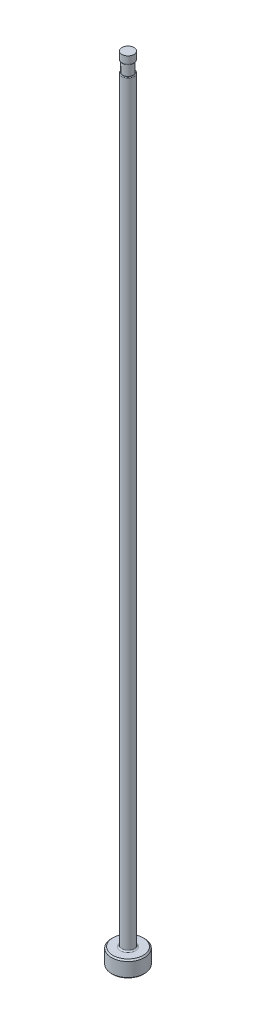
ISO-10303-21;
HEADER;
FILE_DESCRIPTION(('STEP AP214'),'2;1');
FILE_NAME('part.step','',(''),(''),'','','');
FILE_SCHEMA(('AUTOMOTIVE_DESIGN { 1 0 10303 214 1 1 1 1 }'));
ENDSEC;
DATA;
#1=APPLICATION_CONTEXT('core data for automotive mechanical design processes');
#2=APPLICATION_PROTOCOL_DEFINITION('international standard','automotive_design',2000,#1);
#3=PRODUCT_CONTEXT('',#1,'mechanical');
#4=PRODUCT('Part','Part','',(#3));
#5=PRODUCT_RELATED_PRODUCT_CATEGORY('part','',(#4));
#6=PRODUCT_DEFINITION_FORMATION('','',#4);
#7=PRODUCT_DEFINITION_CONTEXT('part definition',#1,'design');
#8=PRODUCT_DEFINITION('design','',#6,#7);
#9=PRODUCT_DEFINITION_SHAPE('','',#8);
#10=(LENGTH_UNIT() NAMED_UNIT(*) SI_UNIT(.MILLI.,.METRE.));
#11=(NAMED_UNIT(*) PLANE_ANGLE_UNIT() SI_UNIT($,.RADIAN.));
#12=(NAMED_UNIT(*) SI_UNIT($,.STERADIAN.) SOLID_ANGLE_UNIT());
#13=UNCERTAINTY_MEASURE_WITH_UNIT(LENGTH_MEASURE(1.E-05),#10,'distance_accuracy_value','');
#14=(GEOMETRIC_REPRESENTATION_CONTEXT(3) GLOBAL_UNCERTAINTY_ASSIGNED_CONTEXT((#13)) GLOBAL_UNIT_ASSIGNED_CONTEXT((#10,
#11,#12)) REPRESENTATION_CONTEXT('',''));
#15=CARTESIAN_POINT('',(0.,0.,0.));
#16=DIRECTION('',(0.,0.,1.));
#17=DIRECTION('',(1.,0.,0.));
#18=AXIS2_PLACEMENT_3D('',#15,#16,#17);
#19=CARTESIAN_POINT('',(-1.18998999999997,150.876,0.));
#20=DIRECTION('',(0.,1.,0.));
#21=DIRECTION('',(0.,0.,1.));
#22=AXIS2_PLACEMENT_3D('',#19,#20,#21);
#23=PLANE('',#22);
#24=CARTESIAN_POINT('',(0.,150.876,0.));
#25=DIRECTION('',(0.,1.,0.));
#26=DIRECTION('',(0.,0.,1.));
#27=AXIS2_PLACEMENT_3D('',#24,#25,#26);
#28=CIRCLE('',#27,1.03758999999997);
#29=CARTESIAN_POINT('',(0.,150.876,1.03758999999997));
#30=VERTEX_POINT('',#29);
#31=EDGE_CURVE('E11',#30,#30,#28,.F.);
#32=ORIENTED_EDGE('',*,*,#31,.T.);
#33=EDGE_LOOP('',(#32));
#34=FACE_BOUND('',#33,.T.);
#35=CARTESIAN_POINT('',(0.,150.876,0.));
#36=DIRECTION('',(0.,1.,0.));
#37=DIRECTION('',(0.,0.,1.));
#38=AXIS2_PLACEMENT_3D('',#35,#36,#37);
#39=CIRCLE('',#38,0.986789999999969);
#40=CARTESIAN_POINT('',(0.,150.876,0.986789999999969));
#41=VERTEX_POINT('',#40);
#42=EDGE_CURVE('E78',#41,#41,#39,.T.);
#43=ORIENTED_EDGE('',*,*,#42,.T.);
#44=EDGE_LOOP('',(#43));
#45=FACE_BOUND('',#44,.T.);
#46=ADVANCED_FACE('F36',(#34,#45),#23,.F.);
#47=CARTESIAN_POINT('',(0.,259.958771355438,0.));
#48=DIRECTION('',(0.,1.,0.));
#49=DIRECTION('',(0.,0.,1.));
#50=AXIS2_PLACEMENT_3D('',#47,#48,#49);
#51=CYLINDRICAL_SURFACE('',#50,1.18998999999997);
#52=DIRECTION('',(0.,1.,0.));
#53=VECTOR('',#52,1.);
#54=CARTESIAN_POINT('',(-0.986789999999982,259.958771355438,-0.66507269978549));
#55=LINE('',#54,#53);
#56=CARTESIAN_POINT('',(-0.986789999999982,148.717,-0.66507269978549));
#57=VERTEX_POINT('',#56);
#58=CARTESIAN_POINT('',(-0.986789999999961,86.36,-0.665072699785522));
#59=VERTEX_POINT('',#58);
#60=EDGE_CURVE('E73',#57,#59,#55,.F.);
#61=ORIENTED_EDGE('',*,*,#60,.F.);
#62=CARTESIAN_POINT('',(0.,148.717,0.));
#63=DIRECTION('',(0.,-1.,0.));
#64=DIRECTION('',(0.,0.,-1.));
#65=AXIS2_PLACEMENT_3D('',#62,#63,#64);
#66=CIRCLE('',#65,1.18998999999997);
#67=CARTESIAN_POINT('',(-0.986789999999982,148.717,0.66507269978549));
#68=VERTEX_POINT('',#67);
#69=EDGE_CURVE('E51',#57,#68,#66,.T.);
#70=ORIENTED_EDGE('',*,*,#69,.T.);
#71=DIRECTION('',(0.,1.,0.));
#72=VECTOR('',#71,1.);
#73=CARTESIAN_POINT('',(-0.986789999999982,259.958771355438,0.66507269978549));
#74=LINE('',#73,#72);
#75=CARTESIAN_POINT('',(-0.986789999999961,86.36,0.665072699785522));
#76=VERTEX_POINT('',#75);
#77=EDGE_CURVE('E84',#76,#68,#74,.T.);
#78=ORIENTED_EDGE('',*,*,#77,.F.);
#79=CARTESIAN_POINT('',(-0.98678999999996,86.36,-0.665072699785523));
#80=CARTESIAN_POINT('',(-0.986779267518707,86.3097455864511,-0.665041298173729));
#81=CARTESIAN_POINT('',(-0.987982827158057,86.2594764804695,-0.663300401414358));
#82=CARTESIAN_POINT('',(-0.992752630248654,86.1591549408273,-0.656166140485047));
#83=CARTESIAN_POINT('',(-0.996326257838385,86.1091036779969,-0.650761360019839));
#84=CARTESIAN_POINT('',(-1.00583006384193,86.0091462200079,-0.635968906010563));
#85=CARTESIAN_POINT('',(-1.01178989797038,85.9592501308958,-0.626531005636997));
#86=CARTESIAN_POINT('',(-1.02587369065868,85.8608860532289,-0.603197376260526));
#87=CARTESIAN_POINT('',(-1.03399424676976,85.8124159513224,-0.589308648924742));
#88=CARTESIAN_POINT('',(-1.05174573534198,85.7193689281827,-0.556987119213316));
#89=CARTESIAN_POINT('',(-1.06130874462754,85.6747141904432,-0.538743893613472));
#90=CARTESIAN_POINT('',(-1.08163376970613,85.5885015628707,-0.496679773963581));
#91=CARTESIAN_POINT('',(-1.09239187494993,85.5469342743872,-0.472876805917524));
#92=CARTESIAN_POINT('',(-1.11191043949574,85.4768889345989,-0.424562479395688));
#93=CARTESIAN_POINT('',(-1.12059949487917,85.4475247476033,-0.401318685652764));
#94=CARTESIAN_POINT('',(-1.13756139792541,85.3927968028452,-0.350355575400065));
#95=CARTESIAN_POINT('',(-1.1458348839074,85.3674267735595,-0.322643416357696));
#96=CARTESIAN_POINT('',(-1.15898696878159,85.3284463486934,-0.270798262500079));
#97=CARTESIAN_POINT('',(-1.16417674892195,85.3135145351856,-0.24774326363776));
#98=CARTESIAN_POINT('',(-1.17342649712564,85.2873860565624,-0.19937625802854));
#99=CARTESIAN_POINT('',(-1.17748715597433,85.2761871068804,-0.174065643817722));
#100=CARTESIAN_POINT('',(-1.18407630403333,85.2582102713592,-0.121438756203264));
#101=CARTESIAN_POINT('',(-1.18659047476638,85.2514736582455,-0.0941062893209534));
#102=CARTESIAN_POINT('',(-1.18968900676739,85.2431911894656,-0.0385610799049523));
#103=CARTESIAN_POINT('',(-1.19027509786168,85.2416406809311,-0.0103491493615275));
#104=CARTESIAN_POINT('',(-1.18949770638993,85.2437102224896,0.0419738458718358));
#105=CARTESIAN_POINT('',(-1.18838954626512,85.2466530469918,0.0661187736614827));
#106=CARTESIAN_POINT('',(-1.18479997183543,85.2562873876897,0.113537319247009));
#107=CARTESIAN_POINT('',(-1.1823183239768,85.26297954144,0.136810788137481));
#108=CARTESIAN_POINT('',(-1.17619659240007,85.279751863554,0.182112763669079));
#109=CARTESIAN_POINT('',(-1.17254841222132,85.2898557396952,0.20413126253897));
#110=CARTESIAN_POINT('',(-1.16439345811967,85.3129140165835,0.246432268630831));
#111=CARTESIAN_POINT('',(-1.15988634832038,85.3258695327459,0.266714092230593));
#112=CARTESIAN_POINT('',(-1.14755888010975,85.3622124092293,0.31649477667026));
#113=CARTESIAN_POINT('',(-1.13931800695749,85.3873279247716,0.344629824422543));
#114=CARTESIAN_POINT('',(-1.12235845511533,85.4416867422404,0.396399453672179));
#115=CARTESIAN_POINT('',(-1.11363866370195,85.4709399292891,0.420022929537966));
#116=CARTESIAN_POINT('',(-1.09186647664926,85.5484930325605,0.474520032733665));
#117=CARTESIAN_POINT('',(-1.07894485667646,85.5987247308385,0.502681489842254));
#118=CARTESIAN_POINT('',(-1.05496207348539,85.703372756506,0.551237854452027));
#119=CARTESIAN_POINT('',(-1.04391025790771,85.7578082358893,0.571594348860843));
#120=CARTESIAN_POINT('',(-1.02648158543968,85.8575321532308,0.60220362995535));
#121=CARTESIAN_POINT('',(-1.01961050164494,85.902371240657,0.613676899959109));
#122=CARTESIAN_POINT('',(-1.00772789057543,85.9931036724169,0.633000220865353));
#123=CARTESIAN_POINT('',(-1.00271814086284,86.0389979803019,0.640846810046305));
#124=CARTESIAN_POINT('',(-0.99475556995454,86.130656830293,0.653140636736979));
#125=CARTESIAN_POINT('',(-0.991771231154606,86.1764117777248,0.657640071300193));
#126=CARTESIAN_POINT('',(-0.987786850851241,86.2681143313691,0.663592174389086));
#127=CARTESIAN_POINT('',(-0.986782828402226,86.314061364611,0.66505095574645));
#128=CARTESIAN_POINT('',(-0.986789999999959,86.36,0.665072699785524));
#129=B_SPLINE_CURVE_WITH_KNOTS('',3,(#79,#80,#81,#82,#83,#84,#85,#86,#87,#88,#89,#90,#91,#92,
#93,#94,#95,#96,#97,#98,#99,#100,#101,#102,#103,#104,#105,#106,#107,#108,#109,#110,#111,#112,
#113,#114,#115,#116,#117,#118,#119,#120,#121,#122,#123,#124,#125,#126,#127,#128),.UNSPECIFIED.,
.F.,.F.,(4,2,2,2,2,2,2,2,2,2,2,2,2,2,2,2,2,2,2,2,2,2,2,2,4),(0.,0.150742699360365,
0.301957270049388,0.455112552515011,0.608028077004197,0.75521904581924,0.901941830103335,
1.01691912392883,1.13171404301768,1.21527204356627,1.29877881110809,1.38304754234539,
1.46724064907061,1.53993547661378,1.61264266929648,1.68586586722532,1.75911775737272,
1.8742700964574,1.98970233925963,2.16578434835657,2.34272217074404,2.48289840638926,
2.62320816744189,2.7612811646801,2.8990763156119),.UNSPECIFIED.);
#130=EDGE_CURVE('E81',#59,#76,#129,.T.);
#131=ORIENTED_EDGE('',*,*,#130,.F.);
#132=EDGE_LOOP('',(#61,#70,#78,#131));
#133=FACE_BOUND('',#132,.T.);
#134=CARTESIAN_POINT('',(0.,3.42900000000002,0.));
#135=DIRECTION('',(0.,1.,0.));
#136=DIRECTION('',(0.,0.,1.));
#137=AXIS2_PLACEMENT_3D('',#134,#135,#136);
#138=CIRCLE('',#137,1.18998999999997);
#139=CARTESIAN_POINT('',(0.,3.42900000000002,1.18998999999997));
#140=VERTEX_POINT('',#139);
#141=EDGE_CURVE('E116',#140,#140,#138,.T.);
#142=ORIENTED_EDGE('',*,*,#141,.T.);
#143=EDGE_LOOP('',(#142));
#144=FACE_BOUND('',#143,.T.);
#145=ADVANCED_FACE('F82',(#133,#144),#51,.T.);
#146=CARTESIAN_POINT('',(0.,0.,0.));
#147=DIRECTION('',(0.,-1.,0.));
#148=DIRECTION('',(0.,0.,-1.));
#149=AXIS2_PLACEMENT_3D('',#146,#147,#148);
#150=PLANE('',#149);
#151=CARTESIAN_POINT('',(0.,0.,0.));
#152=DIRECTION('',(0.,-1.,0.));
#153=DIRECTION('',(0.,0.,-1.));
#154=AXIS2_PLACEMENT_3D('',#151,#152,#153);
#155=CIRCLE('',#154,2.92099999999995);
#156=CARTESIAN_POINT('',(0.,0.,-2.92099999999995));
#157=VERTEX_POINT('',#156);
#158=EDGE_CURVE('E113',#157,#157,#155,.T.);
#159=ORIENTED_EDGE('',*,*,#158,.T.);
#160=EDGE_LOOP('',(#159));
#161=FACE_BOUND('',#160,.T.);
#162=ADVANCED_FACE('F192',(#161),#150,.T.);
#163=CARTESIAN_POINT('',(0.,259.958771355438,0.));
#164=DIRECTION('',(0.,1.,0.));
#165=DIRECTION('',(0.,0.,1.));
#166=AXIS2_PLACEMENT_3D('',#163,#164,#165);
#167=CYLINDRICAL_SURFACE('',#166,3.17499999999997);
#168=CARTESIAN_POINT('',(0.,2.92100000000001,0.));
#169=DIRECTION('',(0.,1.,0.));
#170=DIRECTION('',(0.,0.,1.));
#171=AXIS2_PLACEMENT_3D('',#168,#169,#170);
#172=CIRCLE('',#171,3.17499999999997);
#173=CARTESIAN_POINT('',(0.,2.92100000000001,3.17499999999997));
#174=VERTEX_POINT('',#173);
#175=EDGE_CURVE('E110',#174,#174,#172,.F.);
#176=ORIENTED_EDGE('',*,*,#175,.T.);
#177=EDGE_LOOP('',(#176));
#178=FACE_BOUND('',#177,.T.);
#179=CARTESIAN_POINT('',(0.,0.254000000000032,0.));
#180=DIRECTION('',(0.,-1.,0.));
#181=DIRECTION('',(0.,0.,-1.));
#182=AXIS2_PLACEMENT_3D('',#179,#180,#181);
#183=CIRCLE('',#182,3.17499999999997);
#184=CARTESIAN_POINT('',(0.,0.254000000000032,-3.17499999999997));
#185=VERTEX_POINT('',#184);
#186=EDGE_CURVE('E107',#185,#185,#183,.F.);
#187=ORIENTED_EDGE('',*,*,#186,.T.);
#188=EDGE_LOOP('',(#187));
#189=FACE_BOUND('',#188,.T.);
#190=ADVANCED_FACE('F195',(#178,#189),#167,.T.);
#191=CARTESIAN_POINT('',(-3.17499999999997,3.175,0.));
#192=DIRECTION('',(0.,1.,0.));
#193=DIRECTION('',(0.,0.,1.));
#194=AXIS2_PLACEMENT_3D('',#191,#192,#193);
#195=PLANE('',#194);
#196=CARTESIAN_POINT('',(0.,3.175,0.));
#197=DIRECTION('',(0.,1.,0.));
#198=DIRECTION('',(0.,0.,1.));
#199=AXIS2_PLACEMENT_3D('',#196,#197,#198);
#200=CIRCLE('',#199,1.44398999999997);
#201=CARTESIAN_POINT('',(0.,3.175,1.44398999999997));
#202=VERTEX_POINT('',#201);
#203=EDGE_CURVE('E87',#202,#202,#200,.F.);
#204=ORIENTED_EDGE('',*,*,#203,.T.);
#205=EDGE_LOOP('',(#204));
#206=FACE_BOUND('',#205,.T.);
#207=CARTESIAN_POINT('',(0.,3.175,0.));
#208=DIRECTION('',(0.,1.,0.));
#209=DIRECTION('',(0.,0.,1.));
#210=AXIS2_PLACEMENT_3D('',#207,#208,#209);
#211=CIRCLE('',#210,2.92099999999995);
#212=CARTESIAN_POINT('',(0.,3.175,2.92099999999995));
#213=VERTEX_POINT('',#212);
#214=EDGE_CURVE('E104',#213,#213,#211,.T.);
#215=ORIENTED_EDGE('',*,*,#214,.T.);
#216=EDGE_LOOP('',(#215));
#217=FACE_BOUND('',#216,.T.);
#218=ADVANCED_FACE('F190',(#206,#217),#195,.T.);
#219=CARTESIAN_POINT('',(0.,3.17499999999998,0.));
#220=DIRECTION('',(0.,-1.,0.));
#221=DIRECTION('',(0.,0.,-1.));
#222=AXIS2_PLACEMENT_3D('',#219,#220,#221);
#223=CONICAL_SURFACE('',#222,2.92099999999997,0.7853981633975);
#224=ORIENTED_EDGE('',*,*,#175,.F.);
#225=EDGE_LOOP('',(#224));
#226=FACE_BOUND('',#225,.T.);
#227=ORIENTED_EDGE('',*,*,#214,.F.);
#228=EDGE_LOOP('',(#227));
#229=FACE_BOUND('',#228,.T.);
#230=ADVANCED_FACE('F186',(#226,#229),#223,.T.);
#231=CARTESIAN_POINT('',(0.,0.254000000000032,0.));
#232=DIRECTION('',(0.,1.,0.));
#233=DIRECTION('',(0.,0.,1.));
#234=AXIS2_PLACEMENT_3D('',#231,#232,#233);
#235=CONICAL_SURFACE('',#234,3.17499999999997,0.785398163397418);
#236=ORIENTED_EDGE('',*,*,#158,.F.);
#237=EDGE_LOOP('',(#236));
#238=FACE_BOUND('',#237,.T.);
#239=ORIENTED_EDGE('',*,*,#186,.F.);
#240=EDGE_LOOP('',(#239));
#241=FACE_BOUND('',#240,.T.);
#242=ADVANCED_FACE('F182',(#238,#241),#235,.T.);
#243=CARTESIAN_POINT('',(0.,3.42900000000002,0.));
#244=DIRECTION('',(0.,1.,0.));
#245=DIRECTION('',(0.,0.,1.));
#246=AXIS2_PLACEMENT_3D('',#243,#244,#245);
#247=TOROIDAL_SURFACE('',#246,1.44398999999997,0.254);
#248=ORIENTED_EDGE('',*,*,#203,.F.);
#249=EDGE_LOOP('',(#248));
#250=FACE_BOUND('',#249,.T.);
#251=ORIENTED_EDGE('',*,*,#141,.F.);
#252=EDGE_LOOP('',(#251));
#253=FACE_BOUND('',#252,.T.);
#254=ADVANCED_FACE('F147',(#250,#253),#247,.F.);
#255=CARTESIAN_POINT('',(-1.18998999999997,148.844,0.));
#256=DIRECTION('',(0.,-1.,0.));
#257=DIRECTION('',(0.,0.,-1.));
#258=AXIS2_PLACEMENT_3D('',#255,#256,#257);
#259=PLANE('',#258);
#260=DIRECTION('',(0.,0.,1.));
#261=VECTOR('',#260,1.);
#262=CARTESIAN_POINT('',(-0.986789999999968,148.844,0.));
#263=LINE('',#262,#261);
#264=CARTESIAN_POINT('',(-0.986789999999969,148.844,0.));
#265=VERTEX_POINT('',#264);
#266=CARTESIAN_POINT('',(-0.986789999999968,148.844,0.39521289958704));
#267=VERTEX_POINT('',#266);
#268=EDGE_CURVE('E90',#265,#267,#263,.T.);
#269=ORIENTED_EDGE('',*,*,#268,.T.);
#270=CARTESIAN_POINT('',(0.,148.844,0.));
#271=DIRECTION('',(0.,-1.,0.));
#272=DIRECTION('',(0.,0.,-1.));
#273=AXIS2_PLACEMENT_3D('',#270,#271,#272);
#274=CIRCLE('',#273,1.06298999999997);
#275=CARTESIAN_POINT('',(-0.986789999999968,148.844,-0.39521289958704));
#276=VERTEX_POINT('',#275);
#277=EDGE_CURVE('E86',#267,#276,#274,.F.);
#278=ORIENTED_EDGE('',*,*,#277,.T.);
#279=EDGE_CURVE('E79',#276,#265,#263,.T.);
#280=ORIENTED_EDGE('',*,*,#279,.T.);
#281=CARTESIAN_POINT('',(0.,148.844,0.));
#282=DIRECTION('',(0.,1.,0.));
#283=DIRECTION('',(0.,0.,1.));
#284=AXIS2_PLACEMENT_3D('',#281,#282,#283);
#285=CIRCLE('',#284,0.986789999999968);
#286=EDGE_CURVE('E101',#265,#265,#285,.T.);
#287=ORIENTED_EDGE('',*,*,#286,.F.);
#288=EDGE_LOOP('',(#269,#278,#280,#287));
#289=FACE_BOUND('',#288,.T.);
#290=ADVANCED_FACE('F144',(#289),#259,.F.);
#291=CARTESIAN_POINT('',(0.,153.448281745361,0.));
#292=DIRECTION('',(0.,1.,0.));
#293=DIRECTION('',(0.,0.,1.));
#294=AXIS2_PLACEMENT_3D('',#291,#292,#293);
#295=CYLINDRICAL_SURFACE('',#294,0.986789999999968);
#296=ORIENTED_EDGE('',*,*,#42,.F.);
#297=EDGE_LOOP('',(#296));
#298=FACE_BOUND('',#297,.T.);
#299=ORIENTED_EDGE('',*,*,#286,.T.);
#300=EDGE_LOOP('',(#299));
#301=FACE_BOUND('',#300,.T.);
#302=ADVANCED_FACE('F141',(#298,#301),#295,.T.);
#303=CARTESIAN_POINT('',(-0.986789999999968,149.86,-3.17499999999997));
#304=DIRECTION('',(1.,0.,0.));
#305=DIRECTION('',(0.,1.,0.));
#306=AXIS2_PLACEMENT_3D('',#303,#304,#305);
#307=PLANE('',#306);
#308=ORIENTED_EDGE('',*,*,#279,.F.);
#309=CARTESIAN_POINT('',(-0.986789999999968,148.844,-0.39521289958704));
#310=CARTESIAN_POINT('',(-0.986789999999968,148.843995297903,-0.407444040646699));
#311=CARTESIAN_POINT('',(-0.986789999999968,148.843755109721,-0.419683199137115));
#312=CARTESIAN_POINT('',(-0.986789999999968,148.842653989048,-0.444183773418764));
#313=CARTESIAN_POINT('',(-0.986789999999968,148.841790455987,-0.456445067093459));
#314=CARTESIAN_POINT('',(-0.986789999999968,148.839278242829,-0.481011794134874));
#315=CARTESIAN_POINT('',(-0.986789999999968,148.837621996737,-0.493316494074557));
#316=CARTESIAN_POINT('',(-0.986789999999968,148.833322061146,-0.517737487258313));
#317=CARTESIAN_POINT('',(-0.986789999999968,148.830680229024,-0.529854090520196));
#318=CARTESIAN_POINT('',(-0.986789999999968,148.825166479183,-0.550007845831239));
#319=CARTESIAN_POINT('',(-0.986789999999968,148.822625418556,-0.558134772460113));
#320=CARTESIAN_POINT('',(-0.986789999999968,148.816838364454,-0.574135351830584));
#321=CARTESIAN_POINT('',(-0.986789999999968,148.81359268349,-0.582009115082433));
#322=CARTESIAN_POINT('',(-0.986789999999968,148.806227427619,-0.597422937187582));
#323=CARTESIAN_POINT('',(-0.986789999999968,148.80210093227,-0.60495974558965));
#324=CARTESIAN_POINT('',(-0.986789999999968,148.79281754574,-0.619377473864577));
#325=CARTESIAN_POINT('',(-0.986789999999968,148.787662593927,-0.626259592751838));
#326=CARTESIAN_POINT('',(-0.986789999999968,148.778322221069,-0.636549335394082));
#327=CARTESIAN_POINT('',(-0.986789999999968,148.774503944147,-0.64028870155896));
#328=CARTESIAN_POINT('',(-0.986789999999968,148.766372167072,-0.647191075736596));
#329=CARTESIAN_POINT('',(-0.986789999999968,148.76205907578,-0.650354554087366));
#330=CARTESIAN_POINT('',(-0.986789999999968,148.753638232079,-0.655489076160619));
#331=CARTESIAN_POINT('',(-0.986789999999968,148.749596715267,-0.657567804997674));
#332=CARTESIAN_POINT('',(-0.986789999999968,148.741227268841,-0.661024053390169));
#333=CARTESIAN_POINT('',(-0.986789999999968,148.73690005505,-0.66240325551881));
#334=CARTESIAN_POINT('',(-0.986789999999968,148.72994708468,-0.663934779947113));
#335=CARTESIAN_POINT('',(-0.986789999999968,148.727379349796,-0.664359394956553));
#336=CARTESIAN_POINT('',(-0.986789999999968,148.722208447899,-0.664929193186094));
#337=CARTESIAN_POINT('',(-0.986789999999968,148.719605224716,-0.665073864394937));
#338=CARTESIAN_POINT('',(-0.986789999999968,148.717000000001,-0.665072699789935));
#339=B_SPLINE_CURVE_WITH_KNOTS('',3,(#309,#310,#311,#312,#313,#314,#315,#316,#317,#318,#319,
#320,#321,#322,#323,#324,#325,#326,#327,#328,#329,#330,#331,#332,#333,#334,#335,#336,#337,#338),
.UNSPECIFIED.,.F.,.F.,(4,2,2,2,2,2,2,2,2,2,2,2,2,2,4),(0.,0.0367035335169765,0.0735610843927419,
0.110777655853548,0.147924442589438,0.173443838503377,0.198951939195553,0.224668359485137,
0.25033673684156,0.266328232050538,0.282306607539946,0.295888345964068,0.309437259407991,
0.317231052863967,0.325039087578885),.UNSPECIFIED.);
#340=EDGE_CURVE('E59',#276,#57,#339,.T.);
#341=ORIENTED_EDGE('',*,*,#340,.T.);
#342=ORIENTED_EDGE('',*,*,#60,.T.);
#343=DIRECTION('',(0.,0.,1.));
#344=VECTOR('',#343,1.);
#345=CARTESIAN_POINT('',(-0.986789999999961,86.36,-3.17499999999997));
#346=LINE('',#345,#344);
#347=EDGE_CURVE('E77',#59,#76,#346,.T.);
#348=ORIENTED_EDGE('',*,*,#347,.T.);
#349=ORIENTED_EDGE('',*,*,#77,.T.);
#350=CARTESIAN_POINT('',(-0.986789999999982,148.717,0.66507269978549));
#351=CARTESIAN_POINT('',(-0.986789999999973,148.721976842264,0.665089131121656));
#352=CARTESIAN_POINT('',(-0.986789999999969,148.726932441,0.664550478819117));
#353=CARTESIAN_POINT('',(-0.986789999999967,148.736580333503,0.66251429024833));
#354=CARTESIAN_POINT('',(-0.986789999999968,148.741275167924,0.661028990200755));
#355=CARTESIAN_POINT('',(-0.986789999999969,148.750292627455,0.657253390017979));
#356=CARTESIAN_POINT('',(-0.986789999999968,148.75461696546,0.654967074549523));
#357=CARTESIAN_POINT('',(-0.986789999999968,148.762874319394,0.649756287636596));
#358=CARTESIAN_POINT('',(-0.986789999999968,148.76680595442,0.646829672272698));
#359=CARTESIAN_POINT('',(-0.986789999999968,148.776276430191,0.638773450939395));
#360=CARTESIAN_POINT('',(-0.986789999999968,148.781529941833,0.633310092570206));
#361=CARTESIAN_POINT('',(-0.986789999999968,148.791132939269,0.62165056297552));
#362=CARTESIAN_POINT('',(-0.986789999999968,148.795480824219,0.615453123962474));
#363=CARTESIAN_POINT('',(-0.986789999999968,148.806260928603,0.59794170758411));
#364=CARTESIAN_POINT('',(-0.986789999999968,148.811932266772,0.586163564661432));
#365=CARTESIAN_POINT('',(-0.986789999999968,148.821557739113,0.561881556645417));
#366=CARTESIAN_POINT('',(-0.986789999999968,148.825500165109,0.54937337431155));
#367=CARTESIAN_POINT('',(-0.986789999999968,148.831776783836,0.525021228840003));
#368=CARTESIAN_POINT('',(-0.986789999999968,148.834213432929,0.513202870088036));
#369=CARTESIAN_POINT('',(-0.986789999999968,148.838177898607,0.489402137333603));
#370=CARTESIAN_POINT('',(-0.986789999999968,148.839704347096,0.477419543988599));
#371=CARTESIAN_POINT('',(-0.986789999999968,148.841993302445,0.453722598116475));
#372=CARTESIAN_POINT('',(-0.986789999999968,148.842775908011,0.442010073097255));
#373=CARTESIAN_POINT('',(-0.986789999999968,148.843776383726,0.418600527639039));
#374=CARTESIAN_POINT('',(-0.986789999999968,148.843996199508,0.406903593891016));
#375=CARTESIAN_POINT('',(-0.986789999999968,148.844,0.395212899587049));
#376=B_SPLINE_CURVE_WITH_KNOTS('',3,(#350,#351,#352,#353,#354,#355,#356,#357,#358,#359,#360,
#361,#362,#363,#364,#365,#366,#367,#368,#369,#370,#371,#372,#373,#374,#375),.UNSPECIFIED.,.F.,
.F.,(4,2,2,2,2,2,2,2,2,2,2,2,4),(0.,0.014867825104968,0.0295472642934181,0.0441546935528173,
0.0588118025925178,0.0814211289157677,0.104070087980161,0.143067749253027,0.182325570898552,
0.21848160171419,0.254691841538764,0.289893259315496,0.324972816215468),.UNSPECIFIED.);
#377=EDGE_CURVE('E172',#68,#267,#376,.T.);
#378=ORIENTED_EDGE('',*,*,#377,.T.);
#379=ORIENTED_EDGE('',*,*,#268,.F.);
#380=EDGE_LOOP('',(#308,#341,#342,#348,#349,#378,#379));
#381=FACE_BOUND('',#380,.T.);
#382=ADVANCED_FACE('F75',(#381),#307,.F.);
#383=CARTESIAN_POINT('',(-4.16178999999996,86.36,-3.17499999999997));
#384=DIRECTION('',(0.,0.,1.));
#385=DIRECTION('',(1.,0.,0.));
#386=AXIS2_PLACEMENT_3D('',#383,#384,#385);
#387=CYLINDRICAL_SURFACE('',#386,3.175);
#388=ORIENTED_EDGE('',*,*,#347,.F.);
#389=ORIENTED_EDGE('',*,*,#130,.T.);
#390=EDGE_LOOP('',(#388,#389));
#391=FACE_BOUND('',#390,.T.);
#392=ADVANCED_FACE('F89',(#391),#387,.F.);
#393=CARTESIAN_POINT('',(0.,152.687735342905,0.));
#394=DIRECTION('',(0.,1.,0.));
#395=DIRECTION('',(0.,0.,1.));
#396=AXIS2_PLACEMENT_3D('',#393,#394,#395);
#397=CYLINDRICAL_SURFACE('',#396,1.16458999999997);
#398=CARTESIAN_POINT('',(0.,151.003,0.));
#399=DIRECTION('',(0.,1.,0.));
#400=DIRECTION('',(0.,0.,1.));
#401=AXIS2_PLACEMENT_3D('',#398,#399,#400);
#402=CIRCLE('',#401,1.16458999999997);
#403=CARTESIAN_POINT('',(0.,151.003,1.16458999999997));
#404=VERTEX_POINT('',#403);
#405=EDGE_CURVE('E44',#404,#404,#402,.T.);
#406=ORIENTED_EDGE('',*,*,#405,.T.);
#407=EDGE_LOOP('',(#406));
#408=FACE_BOUND('',#407,.T.);
#409=CARTESIAN_POINT('',(0.,152.4,0.));
#410=DIRECTION('',(0.,1.,0.));
#411=DIRECTION('',(0.,0.,1.));
#412=AXIS2_PLACEMENT_3D('',#409,#410,#411);
#413=CIRCLE('',#412,1.16458999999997);
#414=CARTESIAN_POINT('',(0.,152.4,1.16458999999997));
#415=VERTEX_POINT('',#414);
#416=EDGE_CURVE('E91',#415,#415,#413,.T.);
#417=ORIENTED_EDGE('',*,*,#416,.F.);
#418=EDGE_LOOP('',(#417));
#419=FACE_BOUND('',#418,.T.);
#420=ADVANCED_FACE('F135',(#408,#419),#397,.T.);
#421=CARTESIAN_POINT('',(-1.18998999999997,152.4,0.));
#422=DIRECTION('',(0.,1.,0.));
#423=DIRECTION('',(0.,0.,1.));
#424=AXIS2_PLACEMENT_3D('',#421,#422,#423);
#425=PLANE('',#424);
#426=ORIENTED_EDGE('',*,*,#416,.T.);
#427=EDGE_LOOP('',(#426));
#428=FACE_BOUND('',#427,.T.);
#429=ADVANCED_FACE('F149',(#428),#425,.T.);
#430=CARTESIAN_POINT('',(0.,148.717,0.));
#431=DIRECTION('',(0.,-1.,0.));
#432=DIRECTION('',(0.,0.,-1.));
#433=AXIS2_PLACEMENT_3D('',#430,#431,#432);
#434=TOROIDAL_SURFACE('',#433,1.06298999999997,0.127);
#435=ORIENTED_EDGE('',*,*,#377,.F.);
#436=ORIENTED_EDGE('',*,*,#69,.F.);
#437=ORIENTED_EDGE('',*,*,#340,.F.);
#438=ORIENTED_EDGE('',*,*,#277,.F.);
#439=EDGE_LOOP('',(#435,#436,#437,#438));
#440=FACE_BOUND('',#439,.T.);
#441=ADVANCED_FACE('F151',(#440),#434,.T.);
#442=CARTESIAN_POINT('',(0.,151.003,0.));
#443=DIRECTION('',(0.,1.,0.));
#444=DIRECTION('',(0.,0.,1.));
#445=AXIS2_PLACEMENT_3D('',#442,#443,#444);
#446=TOROIDAL_SURFACE('',#445,1.03758999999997,0.127);
#447=ORIENTED_EDGE('',*,*,#31,.F.);
#448=EDGE_LOOP('',(#447));
#449=FACE_BOUND('',#448,.T.);
#450=ORIENTED_EDGE('',*,*,#405,.F.);
#451=EDGE_LOOP('',(#450));
#452=FACE_BOUND('',#451,.T.);
#453=ADVANCED_FACE('F38',(#449,#452),#446,.T.);
#454=CLOSED_SHELL('',(#46,#145,#162,#190,#218,#230,#242,#254,#290,#302,#382,#392,#420,#429,#441,#453));
#455=MANIFOLD_SOLID_BREP('B2',#454);
#456=ADVANCED_BREP_SHAPE_REPRESENTATION('',(#18,#455),#14);
#457=SHAPE_DEFINITION_REPRESENTATION(#9,#456);
ENDSEC;
END-ISO-10303-21;
